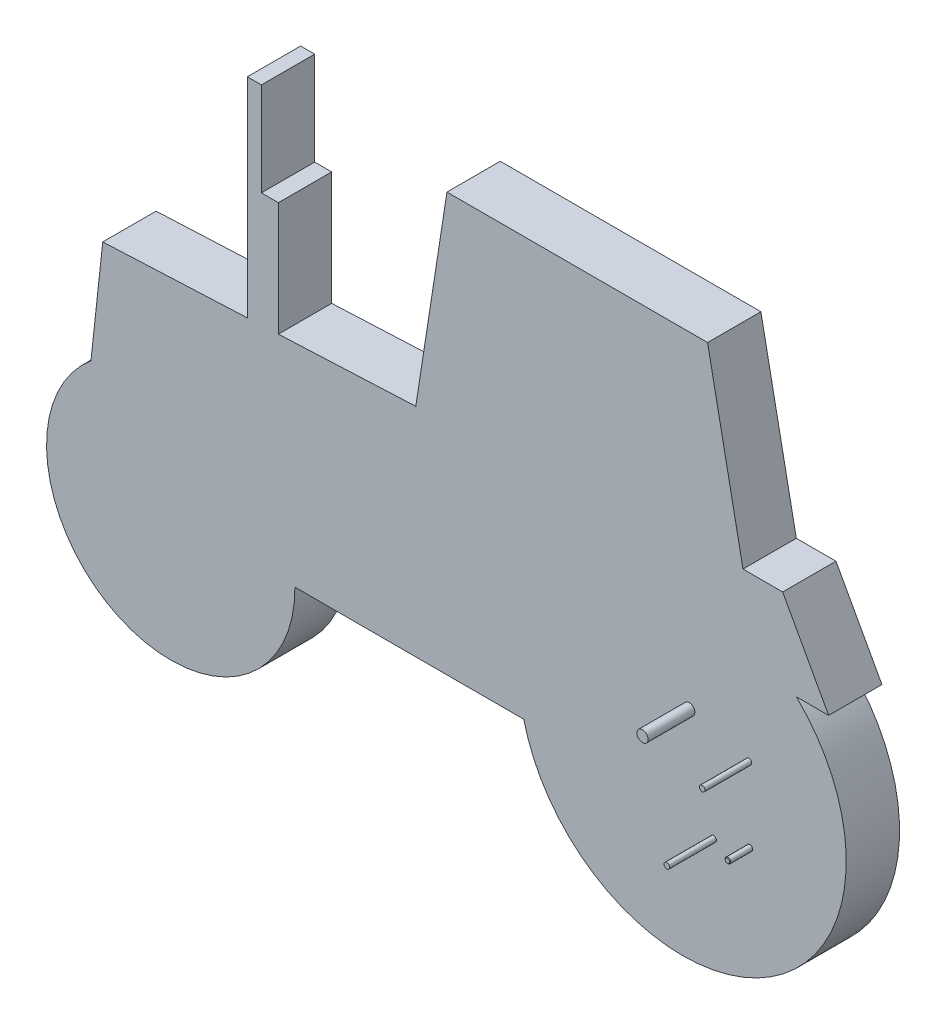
ISO-10303-21;
HEADER;
FILE_DESCRIPTION(('STEP AP214'),'2;1');
FILE_NAME('part.step','',(''),(''),'','','');
FILE_SCHEMA(('AUTOMOTIVE_DESIGN { 1 0 10303 214 1 1 1 1 }'));
ENDSEC;
DATA;
#1=APPLICATION_CONTEXT('core data for automotive mechanical design processes');
#2=APPLICATION_PROTOCOL_DEFINITION('international standard','automotive_design',2000,#1);
#3=PRODUCT_CONTEXT('',#1,'mechanical');
#4=PRODUCT('Part','Part','',(#3));
#5=PRODUCT_RELATED_PRODUCT_CATEGORY('part','',(#4));
#6=PRODUCT_DEFINITION_FORMATION('','',#4);
#7=PRODUCT_DEFINITION_CONTEXT('part definition',#1,'design');
#8=PRODUCT_DEFINITION('design','',#6,#7);
#9=PRODUCT_DEFINITION_SHAPE('','',#8);
#10=(LENGTH_UNIT() NAMED_UNIT(*) SI_UNIT(.MILLI.,.METRE.));
#11=(NAMED_UNIT(*) PLANE_ANGLE_UNIT() SI_UNIT($,.RADIAN.));
#12=(NAMED_UNIT(*) SI_UNIT($,.STERADIAN.) SOLID_ANGLE_UNIT());
#13=UNCERTAINTY_MEASURE_WITH_UNIT(LENGTH_MEASURE(1.E-05),#10,'distance_accuracy_value','');
#14=(GEOMETRIC_REPRESENTATION_CONTEXT(3) GLOBAL_UNCERTAINTY_ASSIGNED_CONTEXT((#13)) GLOBAL_UNIT_ASSIGNED_CONTEXT((#10,
#11,#12)) REPRESENTATION_CONTEXT('',''));
#15=CARTESIAN_POINT('',(0.,0.,0.));
#16=DIRECTION('',(0.,0.,1.));
#17=DIRECTION('',(1.,0.,0.));
#18=AXIS2_PLACEMENT_3D('',#15,#16,#17);
#19=CARTESIAN_POINT('',(-4188.49060145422,103.58082720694,147.5));
#20=DIRECTION('',(0.,0.,-1.));
#21=DIRECTION('',(-1.,0.,0.));
#22=AXIS2_PLACEMENT_3D('',#19,#20,#21);
#23=PLANE('',#22);
#24=CARTESIAN_POINT('',(1453.32297602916,-272.931175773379,147.5));
#25=DIRECTION('',(0.,0.,-1.));
#26=DIRECTION('',(-1.,0.,0.));
#27=AXIS2_PLACEMENT_3D('',#24,#25,#26);
#28=CIRCLE('',#27,14.9999999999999);
#29=CARTESIAN_POINT('',(1438.32297602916,-272.931175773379,147.5));
#30=VERTEX_POINT('',#29);
#31=EDGE_CURVE('E290',#30,#30,#28,.F.);
#32=ORIENTED_EDGE('',*,*,#31,.F.);
#33=EDGE_LOOP('',(#32));
#34=FACE_BOUND('',#33,.T.);
#35=CARTESIAN_POINT('',(1264.32297602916,-724.931175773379,147.5));
#36=DIRECTION('',(0.,0.,-1.));
#37=DIRECTION('',(-1.,0.,0.));
#38=AXIS2_PLACEMENT_3D('',#35,#36,#37);
#39=CIRCLE('',#38,14.9999999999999);
#40=CARTESIAN_POINT('',(1249.32297602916,-724.931175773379,147.5));
#41=VERTEX_POINT('',#40);
#42=EDGE_CURVE('E165',#41,#41,#39,.F.);
#43=ORIENTED_EDGE('',*,*,#42,.F.);
#44=EDGE_LOOP('',(#43));
#45=FACE_BOUND('',#44,.T.);
#46=CARTESIAN_POINT('',(-1637.78659021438,-685.213639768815,147.5));
#47=DIRECTION('',(0.,0.,-1.));
#48=DIRECTION('',(-1.,0.,0.));
#49=AXIS2_PLACEMENT_3D('',#46,#47,#48);
#50=CIRCLE('',#49,663.822151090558);
#51=CARTESIAN_POINT('',(-973.991421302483,-679.228490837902,147.5));
#52=VERTEX_POINT('',#51);
#53=CARTESIAN_POINT('',(-2064.22515226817,-176.47991661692,147.5));
#54=VERTEX_POINT('',#53);
#55=EDGE_CURVE('E211',#52,#54,#50,.T.);
#56=ORIENTED_EDGE('',*,*,#55,.F.);
#57=DIRECTION('',(-1.,0.,0.));
#58=VECTOR('',#57,1.);
#59=CARTESIAN_POINT('',(-4188.49060145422,-679.228490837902,147.5));
#60=LINE('',#59,#58);
#61=CARTESIAN_POINT('',(249.427991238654,-679.228490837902,147.5));
#62=VERTEX_POINT('',#61);
#63=EDGE_CURVE('E162',#62,#52,#60,.T.);
#64=ORIENTED_EDGE('',*,*,#63,.F.);
#65=CARTESIAN_POINT('',(1099.32297602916,-474.931175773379,147.5));
#66=DIRECTION('',(0.,0.,-1.));
#67=DIRECTION('',(-1.,0.,0.));
#68=AXIS2_PLACEMENT_3D('',#65,#66,#67);
#69=CIRCLE('',#68,874.104615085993);
#70=CARTESIAN_POINT('',(1706.81114186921,153.572608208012,147.5));
#71=VERTEX_POINT('',#70);
#72=EDGE_CURVE('E214',#71,#62,#69,.T.);
#73=ORIENTED_EDGE('',*,*,#72,.F.);
#74=DIRECTION('',(1.,0.,0.));
#75=VECTOR('',#74,1.);
#76=CARTESIAN_POINT('',(-4188.49060145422,153.572608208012,147.5));
#77=LINE('',#76,#75);
#78=CARTESIAN_POINT('',(1879.27345494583,153.572608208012,147.5));
#79=VERTEX_POINT('',#78);
#80=EDGE_CURVE('E217',#71,#79,#77,.T.);
#81=ORIENTED_EDGE('',*,*,#80,.T.);
#82=DIRECTION('',(-0.480613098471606,0.876932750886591,0.));
#83=VECTOR('',#82,1.);
#84=CARTESIAN_POINT('',(498.756808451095,2672.48077842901,147.5));
#85=LINE('',#84,#83);
#86=CARTESIAN_POINT('',(1633.46202038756,602.083267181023,147.5));
#87=VERTEX_POINT('',#86);
#88=EDGE_CURVE('E219',#79,#87,#85,.T.);
#89=ORIENTED_EDGE('',*,*,#88,.T.);
#90=DIRECTION('',(-1.,0.,0.));
#91=VECTOR('',#90,1.);
#92=CARTESIAN_POINT('',(-4188.49060145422,602.083267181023,147.5));
#93=LINE('',#92,#91);
#94=CARTESIAN_POINT('',(1421.43664747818,602.083267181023,147.5));
#95=VERTEX_POINT('',#94);
#96=EDGE_CURVE('E221',#87,#95,#93,.T.);
#97=ORIENTED_EDGE('',*,*,#96,.T.);
#98=DIRECTION('',(-0.194618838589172,0.980878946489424,0.));
#99=VECTOR('',#98,1.);
#100=CARTESIAN_POINT('',(1304.11516122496,1193.38355789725,147.5));
#101=LINE('',#100,#99);
#102=CARTESIAN_POINT('',(1232.12827880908,1556.19744527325,147.5));
#103=VERTEX_POINT('',#102);
#104=EDGE_CURVE('E223',#95,#103,#101,.T.);
#105=ORIENTED_EDGE('',*,*,#104,.T.);
#106=DIRECTION('',(-1.,0.,0.));
#107=VECTOR('',#106,1.);
#108=CARTESIAN_POINT('',(-4188.49060145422,1556.19744527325,147.5));
#109=LINE('',#108,#107);
#110=CARTESIAN_POINT('',(-161.181314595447,1556.19744527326,147.5));
#111=VERTEX_POINT('',#110);
#112=EDGE_CURVE('E225',#103,#111,#109,.T.);
#113=ORIENTED_EDGE('',*,*,#112,.T.);
#114=DIRECTION('',(-0.153102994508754,-0.988210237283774,0.));
#115=VECTOR('',#114,1.);
#116=CARTESIAN_POINT('',(-475.361477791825,-471.692698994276,147.5));
#117=LINE('',#116,#115);
#118=CARTESIAN_POINT('',(-327.772679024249,480.925911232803,147.5));
#119=VERTEX_POINT('',#118);
#120=EDGE_CURVE('E227',#111,#119,#117,.T.);
#121=ORIENTED_EDGE('',*,*,#120,.T.);
#122=DIRECTION('',(-0.99897783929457,-0.0452026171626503,0.));
#123=VECTOR('',#122,1.);
#124=CARTESIAN_POINT('',(-4197.6416372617,305.818718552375,147.5));
#125=LINE('',#124,#123);
#126=CARTESIAN_POINT('',(-1062.28914946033,447.689871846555,147.5));
#127=VERTEX_POINT('',#126);
#128=EDGE_CURVE('E229',#119,#127,#125,.T.);
#129=ORIENTED_EDGE('',*,*,#128,.T.);
#130=DIRECTION('',(0.,1.,0.));
#131=VECTOR('',#130,1.);
#132=CARTESIAN_POINT('',(-1062.28914946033,103.58082720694,147.5));
#133=LINE('',#132,#131);
#134=CARTESIAN_POINT('',(-1062.28914946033,1056.42335198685,147.5));
#135=VERTEX_POINT('',#134);
#136=EDGE_CURVE('E231',#127,#135,#133,.T.);
#137=ORIENTED_EDGE('',*,*,#136,.T.);
#138=DIRECTION('',(-1.,0.,0.));
#139=VECTOR('',#138,1.);
#140=CARTESIAN_POINT('',(-4188.49060145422,1056.42335198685,147.5));
#141=LINE('',#140,#139);
#142=CARTESIAN_POINT('',(-1153.1571664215,1056.42335198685,147.5));
#143=VERTEX_POINT('',#142);
#144=EDGE_CURVE('E233',#135,#143,#141,.T.);
#145=ORIENTED_EDGE('',*,*,#144,.T.);
#146=DIRECTION('',(0.,1.,0.));
#147=VECTOR('',#146,1.);
#148=CARTESIAN_POINT('',(-1153.1571664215,103.580827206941,147.5));
#149=LINE('',#148,#147);
#150=CARTESIAN_POINT('',(-1153.1571664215,1556.19744527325,147.5));
#151=VERTEX_POINT('',#150);
#152=EDGE_CURVE('E235',#143,#151,#149,.T.);
#153=ORIENTED_EDGE('',*,*,#152,.T.);
#154=DIRECTION('',(-1.,0.,0.));
#155=VECTOR('',#154,1.);
#156=CARTESIAN_POINT('',(-4188.49060145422,1556.19744527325,147.5));
#157=LINE('',#156,#155);
#158=CARTESIAN_POINT('',(-1228.40705923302,1556.19744527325,147.5));
#159=VERTEX_POINT('',#158);
#160=EDGE_CURVE('E237',#151,#159,#157,.T.);
#161=ORIENTED_EDGE('',*,*,#160,.T.);
#162=DIRECTION('',(0.,-1.,0.));
#163=VECTOR('',#162,1.);
#164=CARTESIAN_POINT('',(-1228.40705923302,103.58082720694,147.5));
#165=LINE('',#164,#163);
#166=CARTESIAN_POINT('',(-1228.40705923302,440.173224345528,147.5));
#167=VERTEX_POINT('',#166);
#168=EDGE_CURVE('E239',#159,#167,#165,.T.);
#169=ORIENTED_EDGE('',*,*,#168,.T.);
#170=CARTESIAN_POINT('',(-2001.25865805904,405.202563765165,147.5));
#171=VERTEX_POINT('',#170);
#172=EDGE_CURVE('E56',#167,#171,#125,.T.);
#173=ORIENTED_EDGE('',*,*,#172,.T.);
#174=DIRECTION('',(-0.107620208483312,-0.994192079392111,0.));
#175=VECTOR('',#174,1.);
#176=CARTESIAN_POINT('',(-2058.86348305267,-126.948986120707,147.5));
#177=LINE('',#176,#175);
#178=EDGE_CURVE('E51',#171,#54,#177,.T.);
#179=ORIENTED_EDGE('',*,*,#178,.T.);
#180=EDGE_LOOP('',(#56,#64,#73,#81,#89,#97,#105,#113,#121,#129,#137,#145,#153,#161,#169,#173,#179));
#181=FACE_BOUND('',#180,.T.);
#182=CARTESIAN_POINT('',(1134.32297602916,-189.931175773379,147.5));
#183=DIRECTION('',(0.,0.,-1.));
#184=DIRECTION('',(-1.,0.,0.));
#185=AXIS2_PLACEMENT_3D('',#182,#183,#184);
#186=CIRCLE('',#185,30.);
#187=CARTESIAN_POINT('',(1104.32297602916,-189.931175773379,147.5));
#188=VERTEX_POINT('',#187);
#189=EDGE_CURVE('E287',#188,#188,#186,.F.);
#190=ORIENTED_EDGE('',*,*,#189,.F.);
#191=EDGE_LOOP('',(#190));
#192=FACE_BOUND('',#191,.T.);
#193=CARTESIAN_POINT('',(1458.29139053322,-669.931175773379,147.5));
#194=DIRECTION('',(0.,0.,-1.));
#195=DIRECTION('',(-1.,0.,0.));
#196=AXIS2_PLACEMENT_3D('',#193,#194,#195);
#197=CIRCLE('',#196,14.9999999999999);
#198=CARTESIAN_POINT('',(1443.29139053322,-669.931175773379,147.5));
#199=VERTEX_POINT('',#198);
#200=EDGE_CURVE('E293',#199,#199,#197,.F.);
#201=ORIENTED_EDGE('',*,*,#200,.F.);
#202=EDGE_LOOP('',(#201));
#203=FACE_BOUND('',#202,.T.);
#204=ADVANCED_FACE('F36',(#34,#45,#181,#192,#203),#23,.F.);
#205=CARTESIAN_POINT('',(-1637.78659021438,-685.213639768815,147.5));
#206=DIRECTION('',(0.,0.,-1.));
#207=DIRECTION('',(-1.,0.,0.));
#208=AXIS2_PLACEMENT_3D('',#205,#206,#207);
#209=CYLINDRICAL_SURFACE('',#208,663.822151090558);
#210=CARTESIAN_POINT('',(-1637.78659021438,-685.213639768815,-137.5));
#211=DIRECTION('',(0.,0.,-1.));
#212=DIRECTION('',(-1.,0.,0.));
#213=AXIS2_PLACEMENT_3D('',#210,#211,#212);
#214=CIRCLE('',#213,663.822151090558);
#215=CARTESIAN_POINT('',(-973.991421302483,-679.228490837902,-137.5));
#216=VERTEX_POINT('',#215);
#217=CARTESIAN_POINT('',(-2064.22515226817,-176.47991661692,-137.5));
#218=VERTEX_POINT('',#217);
#219=EDGE_CURVE('E169',#216,#218,#214,.T.);
#220=ORIENTED_EDGE('',*,*,#219,.F.);
#221=DIRECTION('',(0.,0.,-1.));
#222=VECTOR('',#221,1.);
#223=CARTESIAN_POINT('',(-973.991421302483,-679.228490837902,147.5));
#224=LINE('',#223,#222);
#225=EDGE_CURVE('E155',#52,#216,#224,.T.);
#226=ORIENTED_EDGE('',*,*,#225,.F.);
#227=ORIENTED_EDGE('',*,*,#55,.T.);
#228=DIRECTION('',(0.,0.,-1.));
#229=VECTOR('',#228,1.);
#230=CARTESIAN_POINT('',(-2064.22515226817,-176.47991661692,147.5));
#231=LINE('',#230,#229);
#232=EDGE_CURVE('E170',#54,#218,#231,.T.);
#233=ORIENTED_EDGE('',*,*,#232,.T.);
#234=EDGE_LOOP('',(#220,#226,#227,#233));
#235=FACE_BOUND('',#234,.T.);
#236=ADVANCED_FACE('F38',(#235),#209,.T.);
#237=CARTESIAN_POINT('',(-4188.49060145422,-679.228490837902,147.5));
#238=DIRECTION('',(0.,-1.,0.));
#239=DIRECTION('',(0.,0.,-1.));
#240=AXIS2_PLACEMENT_3D('',#237,#238,#239);
#241=PLANE('',#240);
#242=DIRECTION('',(-1.,0.,0.));
#243=VECTOR('',#242,1.);
#244=CARTESIAN_POINT('',(-4188.49060145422,-679.228490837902,-137.5));
#245=LINE('',#244,#243);
#246=CARTESIAN_POINT('',(249.427991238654,-679.228490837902,-137.5));
#247=VERTEX_POINT('',#246);
#248=EDGE_CURVE('E159',#247,#216,#245,.T.);
#249=ORIENTED_EDGE('',*,*,#248,.F.);
#250=DIRECTION('',(0.,0.,-1.));
#251=VECTOR('',#250,1.);
#252=CARTESIAN_POINT('',(249.427991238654,-679.228490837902,147.5));
#253=LINE('',#252,#251);
#254=EDGE_CURVE('E166',#62,#247,#253,.T.);
#255=ORIENTED_EDGE('',*,*,#254,.F.);
#256=ORIENTED_EDGE('',*,*,#63,.T.);
#257=ORIENTED_EDGE('',*,*,#225,.T.);
#258=EDGE_LOOP('',(#249,#255,#256,#257));
#259=FACE_BOUND('',#258,.T.);
#260=ADVANCED_FACE('F157',(#259),#241,.T.);
#261=CARTESIAN_POINT('',(1099.32297602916,-474.931175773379,147.5));
#262=DIRECTION('',(0.,0.,-1.));
#263=DIRECTION('',(-1.,0.,0.));
#264=AXIS2_PLACEMENT_3D('',#261,#262,#263);
#265=CYLINDRICAL_SURFACE('',#264,874.104615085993);
#266=CARTESIAN_POINT('',(1099.32297602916,-474.931175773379,-137.5));
#267=DIRECTION('',(0.,0.,-1.));
#268=DIRECTION('',(-1.,0.,0.));
#269=AXIS2_PLACEMENT_3D('',#266,#267,#268);
#270=CIRCLE('',#269,874.104615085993);
#271=CARTESIAN_POINT('',(1706.81114186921,153.572608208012,-137.5));
#272=VERTEX_POINT('',#271);
#273=EDGE_CURVE('E179',#272,#247,#270,.T.);
#274=ORIENTED_EDGE('',*,*,#273,.F.);
#275=DIRECTION('',(0.,0.,-1.));
#276=VECTOR('',#275,1.);
#277=CARTESIAN_POINT('',(1706.81114186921,153.572608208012,147.5));
#278=LINE('',#277,#276);
#279=EDGE_CURVE('E282',#71,#272,#278,.T.);
#280=ORIENTED_EDGE('',*,*,#279,.F.);
#281=ORIENTED_EDGE('',*,*,#72,.T.);
#282=ORIENTED_EDGE('',*,*,#254,.T.);
#283=EDGE_LOOP('',(#274,#280,#281,#282));
#284=FACE_BOUND('',#283,.T.);
#285=ADVANCED_FACE('F373',(#284),#265,.T.);
#286=CARTESIAN_POINT('',(-4188.49060145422,153.572608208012,147.5));
#287=DIRECTION('',(0.,1.,0.));
#288=DIRECTION('',(0.,0.,1.));
#289=AXIS2_PLACEMENT_3D('',#286,#287,#288);
#290=PLANE('',#289);
#291=DIRECTION('',(1.,0.,0.));
#292=VECTOR('',#291,1.);
#293=CARTESIAN_POINT('',(-4188.49060145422,153.572608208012,-137.5));
#294=LINE('',#293,#292);
#295=CARTESIAN_POINT('',(1879.27345494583,153.572608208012,-137.5));
#296=VERTEX_POINT('',#295);
#297=EDGE_CURVE('E181',#272,#296,#294,.T.);
#298=ORIENTED_EDGE('',*,*,#297,.T.);
#299=DIRECTION('',(0.,0.,-1.));
#300=VECTOR('',#299,1.);
#301=CARTESIAN_POINT('',(1879.27345494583,153.572608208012,147.5));
#302=LINE('',#301,#300);
#303=EDGE_CURVE('E279',#79,#296,#302,.T.);
#304=ORIENTED_EDGE('',*,*,#303,.F.);
#305=ORIENTED_EDGE('',*,*,#80,.F.);
#306=ORIENTED_EDGE('',*,*,#279,.T.);
#307=EDGE_LOOP('',(#298,#304,#305,#306));
#308=FACE_BOUND('',#307,.T.);
#309=ADVANCED_FACE('F369',(#308),#290,.F.);
#310=CARTESIAN_POINT('',(498.756808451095,2672.48077842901,147.5));
#311=DIRECTION('',(-0.876932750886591,-0.480613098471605,0.));
#312=DIRECTION('',(0.480613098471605,-0.876932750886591,0.));
#313=AXIS2_PLACEMENT_3D('',#310,#311,#312);
#314=PLANE('',#313);
#315=DIRECTION('',(-0.480613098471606,0.876932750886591,0.));
#316=VECTOR('',#315,1.);
#317=CARTESIAN_POINT('',(498.756808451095,2672.48077842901,-137.5));
#318=LINE('',#317,#316);
#319=CARTESIAN_POINT('',(1633.46202038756,602.083267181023,-137.5));
#320=VERTEX_POINT('',#319);
#321=EDGE_CURVE('E186',#296,#320,#318,.T.);
#322=ORIENTED_EDGE('',*,*,#321,.T.);
#323=DIRECTION('',(0.,0.,-1.));
#324=VECTOR('',#323,1.);
#325=CARTESIAN_POINT('',(1633.46202038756,602.083267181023,147.5));
#326=LINE('',#325,#324);
#327=EDGE_CURVE('E276',#87,#320,#326,.T.);
#328=ORIENTED_EDGE('',*,*,#327,.F.);
#329=ORIENTED_EDGE('',*,*,#88,.F.);
#330=ORIENTED_EDGE('',*,*,#303,.T.);
#331=EDGE_LOOP('',(#322,#328,#329,#330));
#332=FACE_BOUND('',#331,.T.);
#333=ADVANCED_FACE('F365',(#332),#314,.F.);
#334=CARTESIAN_POINT('',(-4188.49060145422,602.083267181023,147.5));
#335=DIRECTION('',(0.,-1.,0.));
#336=DIRECTION('',(0.,0.,-1.));
#337=AXIS2_PLACEMENT_3D('',#334,#335,#336);
#338=PLANE('',#337);
#339=DIRECTION('',(-1.,0.,0.));
#340=VECTOR('',#339,1.);
#341=CARTESIAN_POINT('',(-4188.49060145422,602.083267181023,-137.5));
#342=LINE('',#341,#340);
#343=CARTESIAN_POINT('',(1421.43664747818,602.083267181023,-137.5));
#344=VERTEX_POINT('',#343);
#345=EDGE_CURVE('E188',#320,#344,#342,.T.);
#346=ORIENTED_EDGE('',*,*,#345,.T.);
#347=DIRECTION('',(0.,0.,-1.));
#348=VECTOR('',#347,1.);
#349=CARTESIAN_POINT('',(1421.43664747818,602.083267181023,147.5));
#350=LINE('',#349,#348);
#351=EDGE_CURVE('E273',#95,#344,#350,.T.);
#352=ORIENTED_EDGE('',*,*,#351,.F.);
#353=ORIENTED_EDGE('',*,*,#96,.F.);
#354=ORIENTED_EDGE('',*,*,#327,.T.);
#355=EDGE_LOOP('',(#346,#352,#353,#354));
#356=FACE_BOUND('',#355,.T.);
#357=ADVANCED_FACE('F361',(#356),#338,.F.);
#358=CARTESIAN_POINT('',(1304.11516122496,1193.38355789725,147.5));
#359=DIRECTION('',(-0.980878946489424,-0.194618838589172,0.));
#360=DIRECTION('',(0.194618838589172,-0.980878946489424,0.));
#361=AXIS2_PLACEMENT_3D('',#358,#359,#360);
#362=PLANE('',#361);
#363=DIRECTION('',(-0.194618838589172,0.980878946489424,0.));
#364=VECTOR('',#363,1.);
#365=CARTESIAN_POINT('',(1304.11516122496,1193.38355789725,-137.5));
#366=LINE('',#365,#364);
#367=CARTESIAN_POINT('',(1232.12827880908,1556.19744527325,-137.5));
#368=VERTEX_POINT('',#367);
#369=EDGE_CURVE('E190',#344,#368,#366,.T.);
#370=ORIENTED_EDGE('',*,*,#369,.T.);
#371=DIRECTION('',(0.,0.,-1.));
#372=VECTOR('',#371,1.);
#373=CARTESIAN_POINT('',(1232.12827880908,1556.19744527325,147.5));
#374=LINE('',#373,#372);
#375=EDGE_CURVE('E270',#103,#368,#374,.T.);
#376=ORIENTED_EDGE('',*,*,#375,.F.);
#377=ORIENTED_EDGE('',*,*,#104,.F.);
#378=ORIENTED_EDGE('',*,*,#351,.T.);
#379=EDGE_LOOP('',(#370,#376,#377,#378));
#380=FACE_BOUND('',#379,.T.);
#381=ADVANCED_FACE('F357',(#380),#362,.F.);
#382=CARTESIAN_POINT('',(-4188.49060145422,1556.19744527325,147.5));
#383=DIRECTION('',(0.,-1.,0.));
#384=DIRECTION('',(0.,0.,-1.));
#385=AXIS2_PLACEMENT_3D('',#382,#383,#384);
#386=PLANE('',#385);
#387=DIRECTION('',(-1.,0.,0.));
#388=VECTOR('',#387,1.);
#389=CARTESIAN_POINT('',(-4188.49060145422,1556.19744527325,-137.5));
#390=LINE('',#389,#388);
#391=CARTESIAN_POINT('',(-161.181314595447,1556.19744527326,-137.5));
#392=VERTEX_POINT('',#391);
#393=EDGE_CURVE('E192',#368,#392,#390,.T.);
#394=ORIENTED_EDGE('',*,*,#393,.T.);
#395=DIRECTION('',(0.,0.,-1.));
#396=VECTOR('',#395,1.);
#397=CARTESIAN_POINT('',(-161.181314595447,1556.19744527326,147.5));
#398=LINE('',#397,#396);
#399=EDGE_CURVE('E267',#111,#392,#398,.T.);
#400=ORIENTED_EDGE('',*,*,#399,.F.);
#401=ORIENTED_EDGE('',*,*,#112,.F.);
#402=ORIENTED_EDGE('',*,*,#375,.T.);
#403=EDGE_LOOP('',(#394,#400,#401,#402));
#404=FACE_BOUND('',#403,.T.);
#405=ADVANCED_FACE('F353',(#404),#386,.F.);
#406=CARTESIAN_POINT('',(-475.361477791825,-471.692698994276,147.5));
#407=DIRECTION('',(0.988210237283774,-0.153102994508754,0.));
#408=DIRECTION('',(0.153102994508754,0.988210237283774,0.));
#409=AXIS2_PLACEMENT_3D('',#406,#407,#408);
#410=PLANE('',#409);
#411=DIRECTION('',(-0.153102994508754,-0.988210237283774,0.));
#412=VECTOR('',#411,1.);
#413=CARTESIAN_POINT('',(-475.361477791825,-471.692698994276,-137.5));
#414=LINE('',#413,#412);
#415=CARTESIAN_POINT('',(-327.772679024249,480.925911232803,-137.5));
#416=VERTEX_POINT('',#415);
#417=EDGE_CURVE('E194',#392,#416,#414,.T.);
#418=ORIENTED_EDGE('',*,*,#417,.T.);
#419=DIRECTION('',(0.,0.,-1.));
#420=VECTOR('',#419,1.);
#421=CARTESIAN_POINT('',(-327.772679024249,480.925911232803,147.5));
#422=LINE('',#421,#420);
#423=EDGE_CURVE('E264',#119,#416,#422,.T.);
#424=ORIENTED_EDGE('',*,*,#423,.F.);
#425=ORIENTED_EDGE('',*,*,#120,.F.);
#426=ORIENTED_EDGE('',*,*,#399,.T.);
#427=EDGE_LOOP('',(#418,#424,#425,#426));
#428=FACE_BOUND('',#427,.T.);
#429=ADVANCED_FACE('F350',(#428),#410,.F.);
#430=CARTESIAN_POINT('',(-4197.6416372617,305.818718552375,147.5));
#431=DIRECTION('',(0.0452026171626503,-0.99897783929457,0.));
#432=DIRECTION('',(0.99897783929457,0.0452026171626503,0.));
#433=AXIS2_PLACEMENT_3D('',#430,#431,#432);
#434=PLANE('',#433);
#435=DIRECTION('',(-0.99897783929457,-0.0452026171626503,0.));
#436=VECTOR('',#435,1.);
#437=CARTESIAN_POINT('',(-4197.6416372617,305.818718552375,-137.5));
#438=LINE('',#437,#436);
#439=CARTESIAN_POINT('',(-1062.28914946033,447.689871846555,-137.5));
#440=VERTEX_POINT('',#439);
#441=EDGE_CURVE('E196',#416,#440,#438,.T.);
#442=ORIENTED_EDGE('',*,*,#441,.T.);
#443=DIRECTION('',(0.,0.,-1.));
#444=VECTOR('',#443,1.);
#445=CARTESIAN_POINT('',(-1062.28914946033,447.689871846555,147.5));
#446=LINE('',#445,#444);
#447=EDGE_CURVE('E261',#127,#440,#446,.T.);
#448=ORIENTED_EDGE('',*,*,#447,.F.);
#449=ORIENTED_EDGE('',*,*,#128,.F.);
#450=ORIENTED_EDGE('',*,*,#423,.T.);
#451=EDGE_LOOP('',(#442,#448,#449,#450));
#452=FACE_BOUND('',#451,.T.);
#453=ADVANCED_FACE('F330',(#452),#434,.F.);
#454=CARTESIAN_POINT('',(-1062.28914946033,103.58082720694,147.5));
#455=DIRECTION('',(-1.,0.,0.));
#456=DIRECTION('',(0.,0.,1.));
#457=AXIS2_PLACEMENT_3D('',#454,#455,#456);
#458=PLANE('',#457);
#459=DIRECTION('',(0.,1.,0.));
#460=VECTOR('',#459,1.);
#461=CARTESIAN_POINT('',(-1062.28914946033,103.58082720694,-137.5));
#462=LINE('',#461,#460);
#463=CARTESIAN_POINT('',(-1062.28914946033,1056.42335198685,-137.5));
#464=VERTEX_POINT('',#463);
#465=EDGE_CURVE('E198',#440,#464,#462,.T.);
#466=ORIENTED_EDGE('',*,*,#465,.T.);
#467=DIRECTION('',(0.,0.,-1.));
#468=VECTOR('',#467,1.);
#469=CARTESIAN_POINT('',(-1062.28914946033,1056.42335198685,147.5));
#470=LINE('',#469,#468);
#471=EDGE_CURVE('E258',#135,#464,#470,.T.);
#472=ORIENTED_EDGE('',*,*,#471,.F.);
#473=ORIENTED_EDGE('',*,*,#136,.F.);
#474=ORIENTED_EDGE('',*,*,#447,.T.);
#475=EDGE_LOOP('',(#466,#472,#473,#474));
#476=FACE_BOUND('',#475,.T.);
#477=ADVANCED_FACE('F345',(#476),#458,.F.);
#478=CARTESIAN_POINT('',(-4188.49060145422,1056.42335198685,147.5));
#479=DIRECTION('',(0.,-1.,0.));
#480=DIRECTION('',(0.,0.,-1.));
#481=AXIS2_PLACEMENT_3D('',#478,#479,#480);
#482=PLANE('',#481);
#483=DIRECTION('',(-1.,0.,0.));
#484=VECTOR('',#483,1.);
#485=CARTESIAN_POINT('',(-4188.49060145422,1056.42335198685,-137.5));
#486=LINE('',#485,#484);
#487=CARTESIAN_POINT('',(-1153.1571664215,1056.42335198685,-137.5));
#488=VERTEX_POINT('',#487);
#489=EDGE_CURVE('E201',#464,#488,#486,.T.);
#490=ORIENTED_EDGE('',*,*,#489,.T.);
#491=DIRECTION('',(0.,0.,-1.));
#492=VECTOR('',#491,1.);
#493=CARTESIAN_POINT('',(-1153.1571664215,1056.42335198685,147.5));
#494=LINE('',#493,#492);
#495=EDGE_CURVE('E255',#143,#488,#494,.T.);
#496=ORIENTED_EDGE('',*,*,#495,.F.);
#497=ORIENTED_EDGE('',*,*,#144,.F.);
#498=ORIENTED_EDGE('',*,*,#471,.T.);
#499=EDGE_LOOP('',(#490,#496,#497,#498));
#500=FACE_BOUND('',#499,.T.);
#501=ADVANCED_FACE('F341',(#500),#482,.F.);
#502=CARTESIAN_POINT('',(-1153.1571664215,103.580827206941,147.5));
#503=DIRECTION('',(-1.,0.,0.));
#504=DIRECTION('',(0.,-1.,0.));
#505=AXIS2_PLACEMENT_3D('',#502,#503,#504);
#506=PLANE('',#505);
#507=DIRECTION('',(0.,1.,0.));
#508=VECTOR('',#507,1.);
#509=CARTESIAN_POINT('',(-1153.1571664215,103.580827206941,-137.5));
#510=LINE('',#509,#508);
#511=CARTESIAN_POINT('',(-1153.1571664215,1556.19744527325,-137.5));
#512=VERTEX_POINT('',#511);
#513=EDGE_CURVE('E203',#488,#512,#510,.T.);
#514=ORIENTED_EDGE('',*,*,#513,.T.);
#515=DIRECTION('',(0.,0.,-1.));
#516=VECTOR('',#515,1.);
#517=CARTESIAN_POINT('',(-1153.1571664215,1556.19744527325,147.5));
#518=LINE('',#517,#516);
#519=EDGE_CURVE('E252',#151,#512,#518,.T.);
#520=ORIENTED_EDGE('',*,*,#519,.F.);
#521=ORIENTED_EDGE('',*,*,#152,.F.);
#522=ORIENTED_EDGE('',*,*,#495,.T.);
#523=EDGE_LOOP('',(#514,#520,#521,#522));
#524=FACE_BOUND('',#523,.T.);
#525=ADVANCED_FACE('F337',(#524),#506,.F.);
#526=CARTESIAN_POINT('',(-4188.49060145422,1556.19744527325,147.5));
#527=DIRECTION('',(0.,-1.,0.));
#528=DIRECTION('',(0.,0.,-1.));
#529=AXIS2_PLACEMENT_3D('',#526,#527,#528);
#530=PLANE('',#529);
#531=DIRECTION('',(-1.,0.,0.));
#532=VECTOR('',#531,1.);
#533=CARTESIAN_POINT('',(-4188.49060145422,1556.19744527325,-137.5));
#534=LINE('',#533,#532);
#535=CARTESIAN_POINT('',(-1228.40705923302,1556.19744527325,-137.5));
#536=VERTEX_POINT('',#535);
#537=EDGE_CURVE('E205',#512,#536,#534,.T.);
#538=ORIENTED_EDGE('',*,*,#537,.T.);
#539=DIRECTION('',(0.,0.,-1.));
#540=VECTOR('',#539,1.);
#541=CARTESIAN_POINT('',(-1228.40705923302,1556.19744527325,147.5));
#542=LINE('',#541,#540);
#543=EDGE_CURVE('E249',#159,#536,#542,.T.);
#544=ORIENTED_EDGE('',*,*,#543,.F.);
#545=ORIENTED_EDGE('',*,*,#160,.F.);
#546=ORIENTED_EDGE('',*,*,#519,.T.);
#547=EDGE_LOOP('',(#538,#544,#545,#546));
#548=FACE_BOUND('',#547,.T.);
#549=ADVANCED_FACE('F333',(#548),#530,.F.);
#550=CARTESIAN_POINT('',(-1228.40705923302,103.58082720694,147.5));
#551=DIRECTION('',(1.,0.,0.));
#552=DIRECTION('',(0.,0.,-1.));
#553=AXIS2_PLACEMENT_3D('',#550,#551,#552);
#554=PLANE('',#553);
#555=DIRECTION('',(0.,-1.,0.));
#556=VECTOR('',#555,1.);
#557=CARTESIAN_POINT('',(-1228.40705923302,103.58082720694,-137.5));
#558=LINE('',#557,#556);
#559=CARTESIAN_POINT('',(-1228.40705923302,440.173224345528,-137.5));
#560=VERTEX_POINT('',#559);
#561=EDGE_CURVE('E207',#536,#560,#558,.T.);
#562=ORIENTED_EDGE('',*,*,#561,.T.);
#563=DIRECTION('',(0.,0.,-1.));
#564=VECTOR('',#563,1.);
#565=CARTESIAN_POINT('',(-1228.40705923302,440.173224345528,147.5));
#566=LINE('',#565,#564);
#567=EDGE_CURVE('E246',#167,#560,#566,.T.);
#568=ORIENTED_EDGE('',*,*,#567,.F.);
#569=ORIENTED_EDGE('',*,*,#168,.F.);
#570=ORIENTED_EDGE('',*,*,#543,.T.);
#571=EDGE_LOOP('',(#562,#568,#569,#570));
#572=FACE_BOUND('',#571,.T.);
#573=ADVANCED_FACE('F328',(#572),#554,.F.);
#574=CARTESIAN_POINT('',(-2001.25865805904,405.202563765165,-137.5));
#575=VERTEX_POINT('',#574);
#576=EDGE_CURVE('E199',#560,#575,#438,.T.);
#577=ORIENTED_EDGE('',*,*,#576,.T.);
#578=DIRECTION('',(0.,0.,-1.));
#579=VECTOR('',#578,1.);
#580=CARTESIAN_POINT('',(-2001.25865805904,405.202563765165,147.5));
#581=LINE('',#580,#579);
#582=EDGE_CURVE('E243',#171,#575,#581,.T.);
#583=ORIENTED_EDGE('',*,*,#582,.F.);
#584=ORIENTED_EDGE('',*,*,#172,.F.);
#585=ORIENTED_EDGE('',*,*,#567,.T.);
#586=EDGE_LOOP('',(#577,#583,#584,#585));
#587=FACE_BOUND('',#586,.T.);
#588=ADVANCED_FACE('F324',(#587),#434,.F.);
#589=CARTESIAN_POINT('',(-2058.86348305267,-126.948986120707,147.5));
#590=DIRECTION('',(0.99419207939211,-0.107620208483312,0.));
#591=DIRECTION('',(0.107620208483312,0.994192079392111,0.));
#592=AXIS2_PLACEMENT_3D('',#589,#590,#591);
#593=PLANE('',#592);
#594=DIRECTION('',(-0.107620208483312,-0.994192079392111,0.));
#595=VECTOR('',#594,1.);
#596=CARTESIAN_POINT('',(-2058.86348305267,-126.948986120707,-137.5));
#597=LINE('',#596,#595);
#598=EDGE_CURVE('E209',#575,#218,#597,.T.);
#599=ORIENTED_EDGE('',*,*,#598,.T.);
#600=ORIENTED_EDGE('',*,*,#232,.F.);
#601=ORIENTED_EDGE('',*,*,#178,.F.);
#602=ORIENTED_EDGE('',*,*,#582,.T.);
#603=EDGE_LOOP('',(#599,#600,#601,#602));
#604=FACE_BOUND('',#603,.T.);
#605=ADVANCED_FACE('F321',(#604),#593,.F.);
#606=CARTESIAN_POINT('',(-4188.49060145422,103.58082720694,-137.5));
#607=DIRECTION('',(0.,0.,-1.));
#608=DIRECTION('',(-1.,0.,0.));
#609=AXIS2_PLACEMENT_3D('',#606,#607,#608);
#610=PLANE('',#609);
#611=ORIENTED_EDGE('',*,*,#219,.T.);
#612=ORIENTED_EDGE('',*,*,#598,.F.);
#613=ORIENTED_EDGE('',*,*,#576,.F.);
#614=ORIENTED_EDGE('',*,*,#561,.F.);
#615=ORIENTED_EDGE('',*,*,#537,.F.);
#616=ORIENTED_EDGE('',*,*,#513,.F.);
#617=ORIENTED_EDGE('',*,*,#489,.F.);
#618=ORIENTED_EDGE('',*,*,#465,.F.);
#619=ORIENTED_EDGE('',*,*,#441,.F.);
#620=ORIENTED_EDGE('',*,*,#417,.F.);
#621=ORIENTED_EDGE('',*,*,#393,.F.);
#622=ORIENTED_EDGE('',*,*,#369,.F.);
#623=ORIENTED_EDGE('',*,*,#345,.F.);
#624=ORIENTED_EDGE('',*,*,#321,.F.);
#625=ORIENTED_EDGE('',*,*,#297,.F.);
#626=ORIENTED_EDGE('',*,*,#273,.T.);
#627=ORIENTED_EDGE('',*,*,#248,.T.);
#628=EDGE_LOOP('',(#611,#612,#613,#614,#615,#616,#617,#618,#619,#620,#621,#622,#623,#624,#625,
#626,#627));
#629=FACE_BOUND('',#628,.T.);
#630=ADVANCED_FACE('F176',(#629),#610,.T.);
#631=CARTESIAN_POINT('',(1264.32297602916,-724.931175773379,397.5));
#632=DIRECTION('',(0.,0.,-1.));
#633=DIRECTION('',(-1.,0.,0.));
#634=AXIS2_PLACEMENT_3D('',#631,#632,#633);
#635=CYLINDRICAL_SURFACE('',#634,14.9999999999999);
#636=CARTESIAN_POINT('',(1264.32297602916,-724.931175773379,397.5));
#637=DIRECTION('',(0.,0.,1.));
#638=DIRECTION('',(1.,0.,0.));
#639=AXIS2_PLACEMENT_3D('',#636,#637,#638);
#640=CIRCLE('',#639,14.9999999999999);
#641=CARTESIAN_POINT('',(1279.32297602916,-724.931175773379,397.5));
#642=VERTEX_POINT('',#641);
#643=EDGE_CURVE('E174',#642,#642,#640,.T.);
#644=ORIENTED_EDGE('',*,*,#643,.F.);
#645=EDGE_LOOP('',(#644));
#646=FACE_BOUND('',#645,.T.);
#647=ORIENTED_EDGE('',*,*,#42,.T.);
#648=EDGE_LOOP('',(#647));
#649=FACE_BOUND('',#648,.T.);
#650=ADVANCED_FACE('F450',(#646,#649),#635,.T.);
#651=CARTESIAN_POINT('',(1264.32297602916,-724.931175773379,397.5));
#652=DIRECTION('',(0.,0.,1.));
#653=DIRECTION('',(1.,0.,0.));
#654=AXIS2_PLACEMENT_3D('',#651,#652,#653);
#655=PLANE('',#654);
#656=ORIENTED_EDGE('',*,*,#643,.T.);
#657=EDGE_LOOP('',(#656));
#658=FACE_BOUND('',#657,.T.);
#659=ADVANCED_FACE('F456',(#658),#655,.T.);
#660=CARTESIAN_POINT('',(1134.32297602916,-189.931175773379,397.5));
#661=DIRECTION('',(0.,0.,-1.));
#662=DIRECTION('',(-1.,0.,0.));
#663=AXIS2_PLACEMENT_3D('',#660,#661,#662);
#664=CYLINDRICAL_SURFACE('',#663,30.);
#665=CARTESIAN_POINT('',(1134.32297602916,-189.931175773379,397.5));
#666=DIRECTION('',(0.,0.,1.));
#667=DIRECTION('',(1.,0.,0.));
#668=AXIS2_PLACEMENT_3D('',#665,#666,#667);
#669=CIRCLE('',#668,30.);
#670=CARTESIAN_POINT('',(1164.32297602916,-189.931175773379,397.5));
#671=VERTEX_POINT('',#670);
#672=EDGE_CURVE('E595',#671,#671,#669,.T.);
#673=ORIENTED_EDGE('',*,*,#672,.F.);
#674=EDGE_LOOP('',(#673));
#675=FACE_BOUND('',#674,.T.);
#676=ORIENTED_EDGE('',*,*,#189,.T.);
#677=EDGE_LOOP('',(#676));
#678=FACE_BOUND('',#677,.T.);
#679=ADVANCED_FACE('F463',(#675,#678),#664,.T.);
#680=CARTESIAN_POINT('',(1134.32297602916,-189.931175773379,397.5));
#681=DIRECTION('',(0.,0.,1.));
#682=DIRECTION('',(1.,0.,0.));
#683=AXIS2_PLACEMENT_3D('',#680,#681,#682);
#684=PLANE('',#683);
#685=ORIENTED_EDGE('',*,*,#672,.T.);
#686=EDGE_LOOP('',(#685));
#687=FACE_BOUND('',#686,.T.);
#688=ADVANCED_FACE('F471',(#687),#684,.T.);
#689=CARTESIAN_POINT('',(1453.32297602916,-272.931175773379,397.5));
#690=DIRECTION('',(0.,0.,-1.));
#691=DIRECTION('',(-1.,0.,0.));
#692=AXIS2_PLACEMENT_3D('',#689,#690,#691);
#693=CYLINDRICAL_SURFACE('',#692,14.9999999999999);
#694=CARTESIAN_POINT('',(1453.32297602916,-272.931175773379,397.5));
#695=DIRECTION('',(0.,0.,1.));
#696=DIRECTION('',(1.,0.,0.));
#697=AXIS2_PLACEMENT_3D('',#694,#695,#696);
#698=CIRCLE('',#697,14.9999999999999);
#699=CARTESIAN_POINT('',(1468.32297602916,-272.931175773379,397.5));
#700=VERTEX_POINT('',#699);
#701=EDGE_CURVE('E594',#700,#700,#698,.T.);
#702=ORIENTED_EDGE('',*,*,#701,.F.);
#703=EDGE_LOOP('',(#702));
#704=FACE_BOUND('',#703,.T.);
#705=ORIENTED_EDGE('',*,*,#31,.T.);
#706=EDGE_LOOP('',(#705));
#707=FACE_BOUND('',#706,.T.);
#708=ADVANCED_FACE('F479',(#704,#707),#693,.T.);
#709=CARTESIAN_POINT('',(1453.32297602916,-272.931175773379,397.5));
#710=DIRECTION('',(0.,0.,1.));
#711=DIRECTION('',(1.,0.,0.));
#712=AXIS2_PLACEMENT_3D('',#709,#710,#711);
#713=PLANE('',#712);
#714=ORIENTED_EDGE('',*,*,#701,.T.);
#715=EDGE_LOOP('',(#714));
#716=FACE_BOUND('',#715,.T.);
#717=ADVANCED_FACE('F487',(#716),#713,.T.);
#718=CARTESIAN_POINT('',(1458.29139053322,-669.931175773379,267.5));
#719=DIRECTION('',(0.,0.,-1.));
#720=DIRECTION('',(-1.,0.,0.));
#721=AXIS2_PLACEMENT_3D('',#718,#719,#720);
#722=CYLINDRICAL_SURFACE('',#721,14.9999999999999);
#723=CARTESIAN_POINT('',(1458.29139053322,-669.931175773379,264.5));
#724=DIRECTION('',(0.,0.,1.));
#725=DIRECTION('',(1.,0.,0.));
#726=AXIS2_PLACEMENT_3D('',#723,#724,#725);
#727=CIRCLE('',#726,14.9999999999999);
#728=CARTESIAN_POINT('',(1473.29139053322,-669.931175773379,264.5));
#729=VERTEX_POINT('',#728);
#730=EDGE_CURVE('E11',#729,#729,#727,.F.);
#731=ORIENTED_EDGE('',*,*,#730,.T.);
#732=EDGE_LOOP('',(#731));
#733=FACE_BOUND('',#732,.T.);
#734=ORIENTED_EDGE('',*,*,#200,.T.);
#735=EDGE_LOOP('',(#734));
#736=FACE_BOUND('',#735,.T.);
#737=ADVANCED_FACE('F307',(#733,#736),#722,.T.);
#738=CARTESIAN_POINT('',(1458.29139053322,-669.931175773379,267.5));
#739=DIRECTION('',(0.,0.,1.));
#740=DIRECTION('',(1.,0.,0.));
#741=AXIS2_PLACEMENT_3D('',#738,#739,#740);
#742=PLANE('',#741);
#743=CARTESIAN_POINT('',(1458.29139053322,-669.931175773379,267.5));
#744=DIRECTION('',(0.,0.,1.));
#745=DIRECTION('',(1.,0.,0.));
#746=AXIS2_PLACEMENT_3D('',#743,#744,#745);
#747=CIRCLE('',#746,11.9999999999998);
#748=CARTESIAN_POINT('',(1470.29139053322,-669.931175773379,267.5));
#749=VERTEX_POINT('',#748);
#750=EDGE_CURVE('E44',#749,#749,#747,.T.);
#751=ORIENTED_EDGE('',*,*,#750,.T.);
#752=EDGE_LOOP('',(#751));
#753=FACE_BOUND('',#752,.T.);
#754=ADVANCED_FACE('F298',(#753),#742,.T.);
#755=CARTESIAN_POINT('',(1458.29139053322,-669.931175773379,267.5));
#756=DIRECTION('',(0.,0.,-1.));
#757=DIRECTION('',(-1.,0.,0.));
#758=AXIS2_PLACEMENT_3D('',#755,#756,#757);
#759=CONICAL_SURFACE('',#758,11.9999999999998,0.78539816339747);
#760=ORIENTED_EDGE('',*,*,#730,.F.);
#761=EDGE_LOOP('',(#760));
#762=FACE_BOUND('',#761,.T.);
#763=ORIENTED_EDGE('',*,*,#750,.F.);
#764=EDGE_LOOP('',(#763));
#765=FACE_BOUND('',#764,.T.);
#766=ADVANCED_FACE('F300',(#762,#765),#759,.T.);
#767=CLOSED_SHELL('',(#204,#236,#260,#285,#309,#333,#357,#381,#405,#429,#453,#477,#501,#525,
#549,#573,#588,#605,#630,#650,#659,#679,#688,#708,#717,#737,#754,#766));
#768=MANIFOLD_SOLID_BREP('B2',#767);
#769=ADVANCED_BREP_SHAPE_REPRESENTATION('',(#18,#768),#14);
#770=SHAPE_DEFINITION_REPRESENTATION(#9,#769);
ENDSEC;
END-ISO-10303-21;
